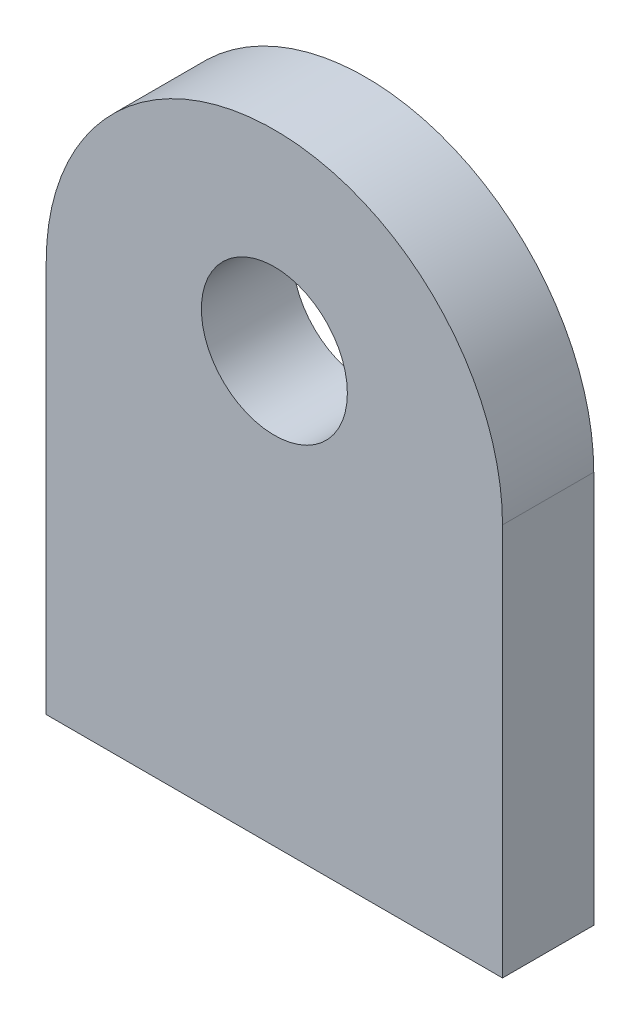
ISO-10303-21;
HEADER;
FILE_DESCRIPTION(('STEP AP214'),'2;1');
FILE_NAME('part.step','',(''),(''),'','','');
FILE_SCHEMA(('AUTOMOTIVE_DESIGN { 1 0 10303 214 1 1 1 1 }'));
ENDSEC;
DATA;
#1=APPLICATION_CONTEXT('core data for automotive mechanical design processes');
#2=APPLICATION_PROTOCOL_DEFINITION('international standard','automotive_design',2000,#1);
#3=PRODUCT_CONTEXT('',#1,'mechanical');
#4=PRODUCT('Part','Part','',(#3));
#5=PRODUCT_RELATED_PRODUCT_CATEGORY('part','',(#4));
#6=PRODUCT_DEFINITION_FORMATION('','',#4);
#7=PRODUCT_DEFINITION_CONTEXT('part definition',#1,'design');
#8=PRODUCT_DEFINITION('design','',#6,#7);
#9=PRODUCT_DEFINITION_SHAPE('','',#8);
#10=(LENGTH_UNIT() NAMED_UNIT(*) SI_UNIT(.MILLI.,.METRE.));
#11=(NAMED_UNIT(*) PLANE_ANGLE_UNIT() SI_UNIT($,.RADIAN.));
#12=(NAMED_UNIT(*) SI_UNIT($,.STERADIAN.) SOLID_ANGLE_UNIT());
#13=UNCERTAINTY_MEASURE_WITH_UNIT(LENGTH_MEASURE(1.E-05),#10,'distance_accuracy_value','');
#14=(GEOMETRIC_REPRESENTATION_CONTEXT(3) GLOBAL_UNCERTAINTY_ASSIGNED_CONTEXT((#13)) GLOBAL_UNIT_ASSIGNED_CONTEXT((#10,
#11,#12)) REPRESENTATION_CONTEXT('',''));
#15=CARTESIAN_POINT('',(0.,0.,0.));
#16=DIRECTION('',(0.,0.,1.));
#17=DIRECTION('',(1.,0.,0.));
#18=AXIS2_PLACEMENT_3D('',#15,#16,#17);
#19=CARTESIAN_POINT('',(-12.5,21.5,5.));
#20=DIRECTION('',(1.,0.,0.));
#21=DIRECTION('',(0.,1.,0.));
#22=AXIS2_PLACEMENT_3D('',#19,#20,#21);
#23=PLANE('',#22);
#24=DIRECTION('',(0.,-1.,0.));
#25=VECTOR('',#24,1.);
#26=CARTESIAN_POINT('',(-12.5,21.5,0.));
#27=LINE('',#26,#25);
#28=CARTESIAN_POINT('',(-12.5,21.5,0.));
#29=VERTEX_POINT('',#28);
#30=CARTESIAN_POINT('',(-12.5,0.,0.));
#31=VERTEX_POINT('',#30);
#32=EDGE_CURVE('E95',#29,#31,#27,.T.);
#33=ORIENTED_EDGE('',*,*,#32,.T.);
#34=DIRECTION('',(0.,0.,-1.));
#35=VECTOR('',#34,1.);
#36=CARTESIAN_POINT('',(-12.5,0.,5.));
#37=LINE('',#36,#35);
#38=CARTESIAN_POINT('',(-12.5,0.,5.));
#39=VERTEX_POINT('',#38);
#40=EDGE_CURVE('E11',#39,#31,#37,.T.);
#41=ORIENTED_EDGE('',*,*,#40,.F.);
#42=DIRECTION('',(0.,-1.,0.));
#43=VECTOR('',#42,1.);
#44=CARTESIAN_POINT('',(-12.5,21.5,5.));
#45=LINE('',#44,#43);
#46=CARTESIAN_POINT('',(-12.5,21.5,5.));
#47=VERTEX_POINT('',#46);
#48=EDGE_CURVE('E83',#47,#39,#45,.T.);
#49=ORIENTED_EDGE('',*,*,#48,.F.);
#50=DIRECTION('',(0.,0.,-1.));
#51=VECTOR('',#50,1.);
#52=CARTESIAN_POINT('',(-12.5,21.5,5.));
#53=LINE('',#52,#51);
#54=EDGE_CURVE('E91',#47,#29,#53,.T.);
#55=ORIENTED_EDGE('',*,*,#54,.T.);
#56=EDGE_LOOP('',(#33,#41,#49,#55));
#57=FACE_BOUND('',#56,.T.);
#58=ADVANCED_FACE('F32',(#57),#23,.F.);
#59=CARTESIAN_POINT('',(-12.5,0.,5.));
#60=DIRECTION('',(0.,1.,0.));
#61=DIRECTION('',(-1.,0.,0.));
#62=AXIS2_PLACEMENT_3D('',#59,#60,#61);
#63=PLANE('',#62);
#64=DIRECTION('',(1.,0.,0.));
#65=VECTOR('',#64,1.);
#66=CARTESIAN_POINT('',(-12.5,0.,0.));
#67=LINE('',#66,#65);
#68=CARTESIAN_POINT('',(12.5,0.,0.));
#69=VERTEX_POINT('',#68);
#70=EDGE_CURVE('E87',#31,#69,#67,.T.);
#71=ORIENTED_EDGE('',*,*,#70,.T.);
#72=DIRECTION('',(0.,0.,-1.));
#73=VECTOR('',#72,1.);
#74=CARTESIAN_POINT('',(12.5,0.,5.));
#75=LINE('',#74,#73);
#76=CARTESIAN_POINT('',(12.5,0.,5.));
#77=VERTEX_POINT('',#76);
#78=EDGE_CURVE('E40',#77,#69,#75,.T.);
#79=ORIENTED_EDGE('',*,*,#78,.F.);
#80=DIRECTION('',(1.,0.,0.));
#81=VECTOR('',#80,1.);
#82=CARTESIAN_POINT('',(-12.5,0.,5.));
#83=LINE('',#82,#81);
#84=EDGE_CURVE('E78',#39,#77,#83,.T.);
#85=ORIENTED_EDGE('',*,*,#84,.F.);
#86=ORIENTED_EDGE('',*,*,#40,.T.);
#87=EDGE_LOOP('',(#71,#79,#85,#86));
#88=FACE_BOUND('',#87,.T.);
#89=ADVANCED_FACE('F86',(#88),#63,.F.);
#90=CARTESIAN_POINT('',(12.5,0.,5.));
#91=DIRECTION('',(-1.,0.,0.));
#92=DIRECTION('',(0.,-1.,0.));
#93=AXIS2_PLACEMENT_3D('',#90,#91,#92);
#94=PLANE('',#93);
#95=DIRECTION('',(0.,1.,0.));
#96=VECTOR('',#95,1.);
#97=CARTESIAN_POINT('',(12.5,0.,0.));
#98=LINE('',#97,#96);
#99=CARTESIAN_POINT('',(12.5,21.5,0.));
#100=VERTEX_POINT('',#99);
#101=EDGE_CURVE('E65',#69,#100,#98,.T.);
#102=ORIENTED_EDGE('',*,*,#101,.T.);
#103=DIRECTION('',(0.,0.,-1.));
#104=VECTOR('',#103,1.);
#105=CARTESIAN_POINT('',(12.5,21.5,5.));
#106=LINE('',#105,#104);
#107=CARTESIAN_POINT('',(12.5,21.5,5.));
#108=VERTEX_POINT('',#107);
#109=EDGE_CURVE('E88',#108,#100,#106,.T.);
#110=ORIENTED_EDGE('',*,*,#109,.F.);
#111=DIRECTION('',(0.,1.,0.));
#112=VECTOR('',#111,1.);
#113=CARTESIAN_POINT('',(12.5,0.,5.));
#114=LINE('',#113,#112);
#115=EDGE_CURVE('E81',#77,#108,#114,.T.);
#116=ORIENTED_EDGE('',*,*,#115,.F.);
#117=ORIENTED_EDGE('',*,*,#78,.T.);
#118=EDGE_LOOP('',(#102,#110,#116,#117));
#119=FACE_BOUND('',#118,.T.);
#120=ADVANCED_FACE('F89',(#119),#94,.F.);
#121=CARTESIAN_POINT('',(0.,21.5,5.));
#122=DIRECTION('',(0.,0.,-1.));
#123=DIRECTION('',(-1.,0.,0.));
#124=AXIS2_PLACEMENT_3D('',#121,#122,#123);
#125=CYLINDRICAL_SURFACE('',#124,12.5);
#126=CARTESIAN_POINT('',(0.,21.5,0.));
#127=DIRECTION('',(0.,0.,1.));
#128=DIRECTION('',(1.,0.,0.));
#129=AXIS2_PLACEMENT_3D('',#126,#127,#128);
#130=CIRCLE('',#129,12.5);
#131=EDGE_CURVE('E71',#100,#29,#130,.T.);
#132=ORIENTED_EDGE('',*,*,#131,.T.);
#133=ORIENTED_EDGE('',*,*,#54,.F.);
#134=CARTESIAN_POINT('',(0.,21.5,5.));
#135=DIRECTION('',(0.,0.,1.));
#136=DIRECTION('',(1.,0.,0.));
#137=AXIS2_PLACEMENT_3D('',#134,#135,#136);
#138=CIRCLE('',#137,12.5);
#139=EDGE_CURVE('E48',#108,#47,#138,.T.);
#140=ORIENTED_EDGE('',*,*,#139,.F.);
#141=ORIENTED_EDGE('',*,*,#109,.T.);
#142=EDGE_LOOP('',(#132,#133,#140,#141));
#143=FACE_BOUND('',#142,.T.);
#144=ADVANCED_FACE('F103',(#143),#125,.T.);
#145=CARTESIAN_POINT('',(0.,21.5,5.));
#146=DIRECTION('',(0.,0.,1.));
#147=DIRECTION('',(1.,0.,0.));
#148=AXIS2_PLACEMENT_3D('',#145,#146,#147);
#149=PLANE('',#148);
#150=CARTESIAN_POINT('',(0.,23.5,5.));
#151=DIRECTION('',(0.,0.,1.));
#152=DIRECTION('',(1.,0.,0.));
#153=AXIS2_PLACEMENT_3D('',#150,#151,#152);
#154=CIRCLE('',#153,4.);
#155=CARTESIAN_POINT('',(4.,23.5,5.));
#156=VERTEX_POINT('',#155);
#157=EDGE_CURVE('E109',#156,#156,#154,.T.);
#158=ORIENTED_EDGE('',*,*,#157,.F.);
#159=EDGE_LOOP('',(#158));
#160=FACE_BOUND('',#159,.T.);
#161=ORIENTED_EDGE('',*,*,#48,.T.);
#162=ORIENTED_EDGE('',*,*,#84,.T.);
#163=ORIENTED_EDGE('',*,*,#115,.T.);
#164=ORIENTED_EDGE('',*,*,#139,.T.);
#165=EDGE_LOOP('',(#161,#162,#163,#164));
#166=FACE_BOUND('',#165,.T.);
#167=ADVANCED_FACE('F79',(#160,#166),#149,.T.);
#168=CARTESIAN_POINT('',(0.,21.5,0.));
#169=DIRECTION('',(0.,0.,1.));
#170=DIRECTION('',(1.,0.,0.));
#171=AXIS2_PLACEMENT_3D('',#168,#169,#170);
#172=PLANE('',#171);
#173=CARTESIAN_POINT('',(0.,23.5,0.));
#174=DIRECTION('',(0.,0.,1.));
#175=DIRECTION('',(1.,0.,0.));
#176=AXIS2_PLACEMENT_3D('',#173,#174,#175);
#177=CIRCLE('',#176,4.);
#178=CARTESIAN_POINT('',(4.,23.5,0.));
#179=VERTEX_POINT('',#178);
#180=EDGE_CURVE('E98',#179,#179,#177,.T.);
#181=ORIENTED_EDGE('',*,*,#180,.T.);
#182=EDGE_LOOP('',(#181));
#183=FACE_BOUND('',#182,.T.);
#184=ORIENTED_EDGE('',*,*,#32,.F.);
#185=ORIENTED_EDGE('',*,*,#131,.F.);
#186=ORIENTED_EDGE('',*,*,#101,.F.);
#187=ORIENTED_EDGE('',*,*,#70,.F.);
#188=EDGE_LOOP('',(#184,#185,#186,#187));
#189=FACE_BOUND('',#188,.T.);
#190=ADVANCED_FACE('F106',(#183,#189),#172,.F.);
#191=CARTESIAN_POINT('',(0.,23.5,0.));
#192=DIRECTION('',(0.,0.,1.));
#193=DIRECTION('',(1.,0.,0.));
#194=AXIS2_PLACEMENT_3D('',#191,#192,#193);
#195=CYLINDRICAL_SURFACE('',#194,4.);
#196=ORIENTED_EDGE('',*,*,#180,.F.);
#197=EDGE_LOOP('',(#196));
#198=FACE_BOUND('',#197,.T.);
#199=ORIENTED_EDGE('',*,*,#157,.T.);
#200=EDGE_LOOP('',(#199));
#201=FACE_BOUND('',#200,.T.);
#202=ADVANCED_FACE('F116',(#198,#201),#195,.F.);
#203=CLOSED_SHELL('',(#58,#89,#120,#144,#167,#190,#202));
#204=MANIFOLD_SOLID_BREP('B2',#203);
#205=ADVANCED_BREP_SHAPE_REPRESENTATION('',(#18,#204),#14);
#206=SHAPE_DEFINITION_REPRESENTATION(#9,#205);
ENDSEC;
END-ISO-10303-21;
